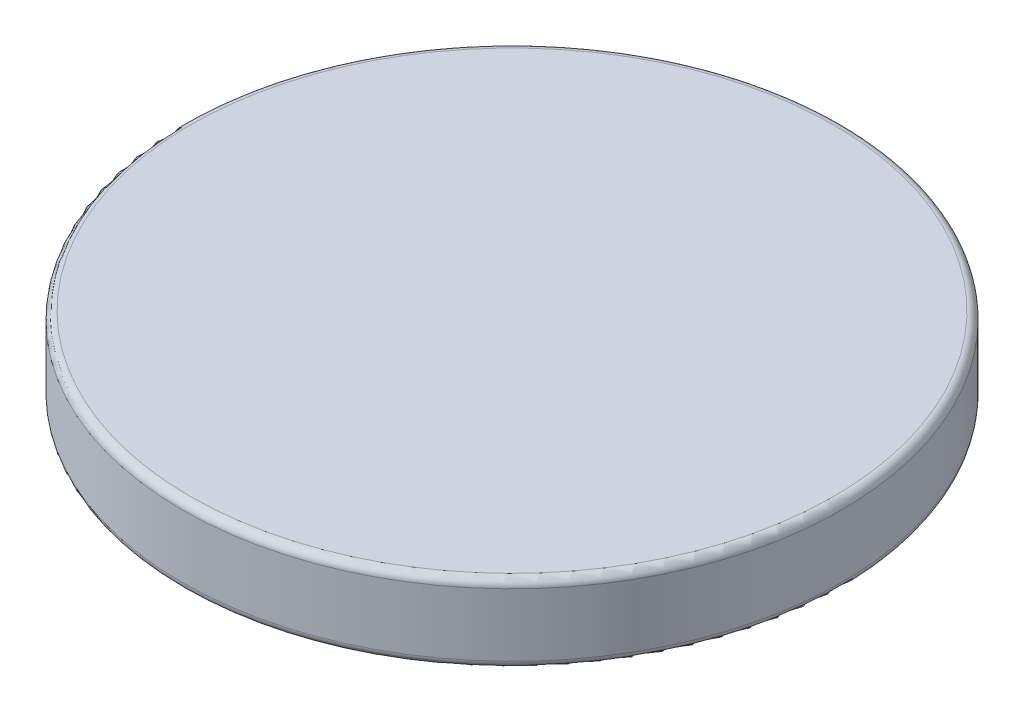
from build123d import *

# Parameters (mm, degrees)
SKETCH_1_R      = 21
EXTRUDE_1_DEPTH = 5
FILLET_1_R      = 0.5


with BuildPart() as part:
    # Sketch 1 → Extrude 1 (new body)
    with BuildSketch(Plane(origin=(0, 0, 0), x_dir=(1, 0, 0), z_dir=(0, 1, 0))):
        with Locations(Location((0, 0, 0), (0, 0, 270))):
            Circle(SKETCH_1_R)
    extrude(amount=EXTRUDE_1_DEPTH)

    # Fillet 1
    fillet_1_edges = [part.edges().sort_by_distance(p)[0] for p in [
        (0, 0, -21),
        (0, 5, -21),
    ]]
    fillet(fillet_1_edges, radius=FILLET_1_R)


solid = part.part
